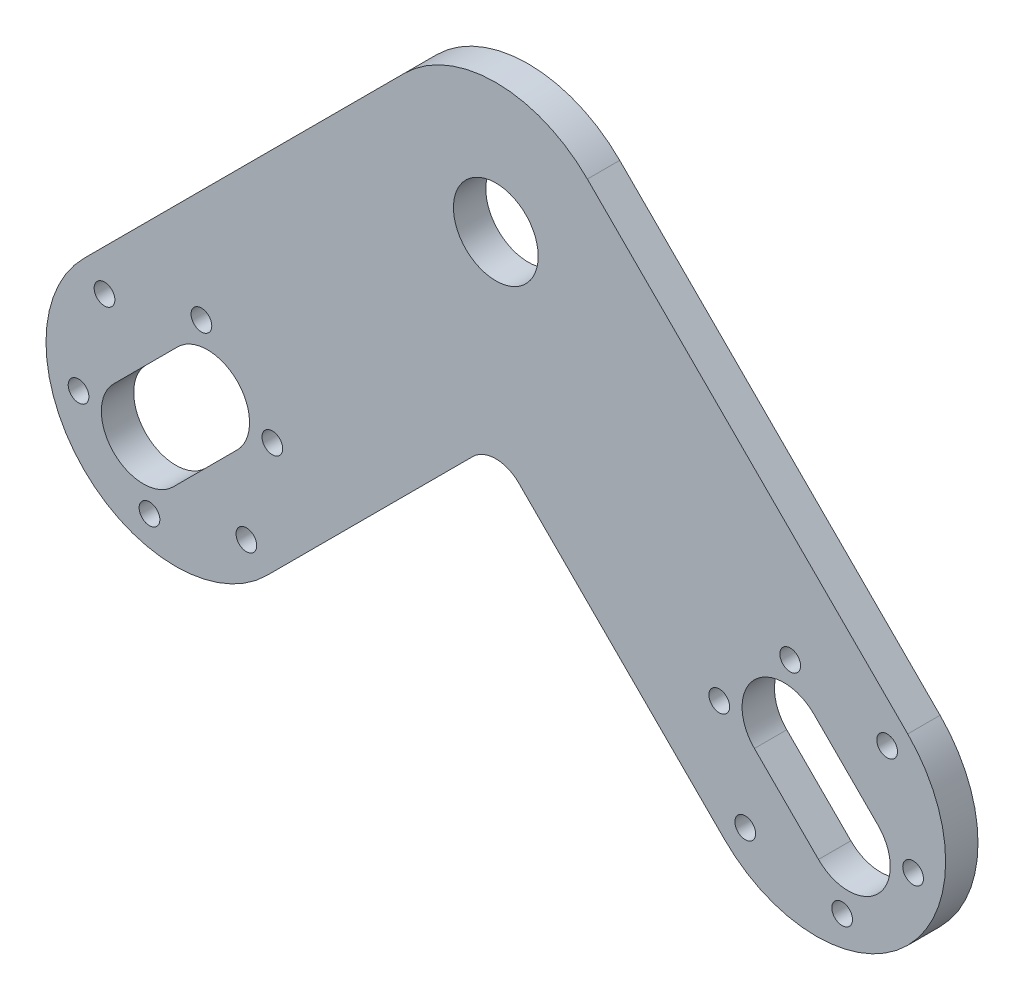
from build123d import *

# Parameters (mm, degrees)
EXTRUDE_1_DEPTH     = 5
FILLET_1_R          = 5
CUT_EXTRUDE_1_DEPTH = 10
SKETCH_3_R          = 6.55
CUT_EXTRUDE_2_DEPTH = 6


with BuildPart() as part:
    # Sketch 1 → Extrude 1 (new body)
    with BuildSketch(Plane.XY):
        with BuildLine():
            Line((49.497474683, 21.213203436), (84.852813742, -14.142135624))
            ThreePointArc((84.852813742, -14.142135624), (113.13708499, -14.142135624), (113.13708499, 14.142135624))
            Line((113.13708499, 14.142135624), (63.639610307, 63.639610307))
            ThreePointArc((63.639610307, 63.639610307), (49.497474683, 69.497474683), (35.355339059, 63.639610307))
            Line((35.355339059, 63.639610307), (-14.142135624, 14.142135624))
            ThreePointArc((-14.142135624, 14.142135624), (-14.142135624, -14.142135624), (14.142135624, -14.142135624))
            Line((14.142135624, -14.142135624), (49.497474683, 21.213203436))
        make_face()
    extrude(amount=EXTRUDE_1_DEPTH)

    # Fillet 1
    fillet_1_edges = [part.edges().sort_by_distance(p)[0] for p in [
        (49.497474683, 21.213203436, 2.5),
    ]]
    fillet(fillet_1_edges, radius=FILLET_1_R)

    # Sketch 2 → Cut-Extrude 1 (cut)
    with BuildSketch(Plane(origin=(0, 0, 0), x_dir=(-1, 0, 0), z_dir=(0, 0, -1))):
        with BuildLine():
            ThreePointArc((-99.348502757, -9.545941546), (-108.540890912, -9.545941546), (-108.540890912, -0.353553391))
            Line((-108.540890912, -0.353553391), (-98.641395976, 9.545941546))
            ThreePointArc((-98.641395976, 9.545941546), (-89.44900782, 9.545941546), (-89.44900782, 0.353553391))
            Line((-89.44900782, 0.353553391), (-99.348502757, -9.545941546))
        make_face()
        with BuildLine():
            ThreePointArc((-93.851883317, 13.840479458), (-96.114625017, 13.840479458), (-96.114625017, 16.103221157))
            ThreePointArc((-96.114625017, 16.103221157), (-93.851883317, 16.103221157), (-93.851883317, 13.840479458))
        make_face()
        with BuildLine():
            ThreePointArc((-108.823733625, 9.828784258), (-111.086475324, 9.828784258), (-111.086475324, 12.091525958))
            ThreePointArc((-111.086475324, 12.091525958), (-108.823733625, 12.091525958), (-108.823733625, 9.828784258))
        make_face()
        with BuildLine():
            ThreePointArc((-112.835428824, -5.143066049), (-115.098170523, -5.143066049), (-115.098170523, -2.880324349))
            ThreePointArc((-115.098170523, -2.880324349), (-112.835428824, -2.880324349), (-112.835428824, -5.143066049))
        make_face()
        with BuildLine():
            ThreePointArc((-82.891728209, 2.880324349), (-85.154469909, 2.880324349), (-85.154469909, 5.143066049))
            ThreePointArc((-85.154469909, 5.143066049), (-82.891728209, 5.143066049), (-82.891728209, 2.880324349))
        make_face()
        with BuildLine():
            ThreePointArc((-86.903423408, -12.091525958), (-89.166165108, -12.091525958), (-89.166165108, -9.828784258))
            ThreePointArc((-89.166165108, -9.828784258), (-86.903423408, -9.828784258), (-86.903423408, -12.091525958))
        make_face()
        with BuildLine():
            ThreePointArc((-104.138015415, -13.840479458), (-101.875273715, -13.840479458), (-101.875273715, -16.103221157))
            ThreePointArc((-101.875273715, -16.103221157), (-104.138015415, -16.103221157), (-104.138015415, -13.840479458))
        make_face()
        with BuildLine():
            ThreePointArc((-16.103221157, 2.880324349), (-13.840479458, 2.880324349), (-13.840479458, 5.143066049))
            ThreePointArc((-13.840479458, 5.143066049), (-16.103221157, 5.143066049), (-16.103221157, 2.880324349))
        make_face()
        with BuildLine():
            Line((9.545941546, -0.353553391), (-0.353553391, 9.545941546))
            ThreePointArc((-0.353553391, 9.545941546), (-9.545941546, 9.545941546), (-9.545941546, 0.353553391))
            Line((-9.545941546, 0.353553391), (0.353553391, -9.545941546))
            ThreePointArc((0.353553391, -9.545941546), (9.545941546, -9.545941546), (9.545941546, -0.353553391))
        make_face()
        with BuildLine():
            ThreePointArc((-5.143066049, 13.840479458), (-2.880324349, 13.840479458), (-2.880324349, 16.103221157))
            ThreePointArc((-2.880324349, 16.103221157), (-5.143066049, 16.103221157), (-5.143066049, 13.840479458))
        make_face()
        with BuildLine():
            ThreePointArc((9.828784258, 9.828784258), (12.091525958, 9.828784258), (12.091525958, 12.091525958))
            ThreePointArc((12.091525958, 12.091525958), (9.828784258, 12.091525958), (9.828784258, 9.828784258))
        make_face()
        with BuildLine():
            ThreePointArc((13.840479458, -5.143066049), (16.103221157, -5.143066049), (16.103221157, -2.880324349))
            ThreePointArc((16.103221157, -2.880324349), (13.840479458, -2.880324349), (13.840479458, -5.143066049))
        make_face()
        with BuildLine():
            ThreePointArc((2.880324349, -16.103221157), (5.143066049, -16.103221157), (5.143066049, -13.840479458))
            ThreePointArc((5.143066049, -13.840479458), (2.880324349, -13.840479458), (2.880324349, -16.103221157))
        make_face()
        with BuildLine():
            ThreePointArc((-12.091525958, -12.091525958), (-9.828784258, -12.091525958), (-9.828784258, -9.828784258))
            ThreePointArc((-9.828784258, -9.828784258), (-12.091525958, -9.828784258), (-12.091525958, -12.091525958))
        make_face()
    extrude(amount=-CUT_EXTRUDE_1_DEPTH, mode=Mode.SUBTRACT)

    # Sketch 3 → Cut-Extrude 2 (cut)
    with BuildSketch(Plane.XY.offset(5)):
        with Locations((49.497474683, 49.497474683)):
            Circle(SKETCH_3_R)
    extrude(amount=-CUT_EXTRUDE_2_DEPTH, mode=Mode.SUBTRACT)


solid = part.part
